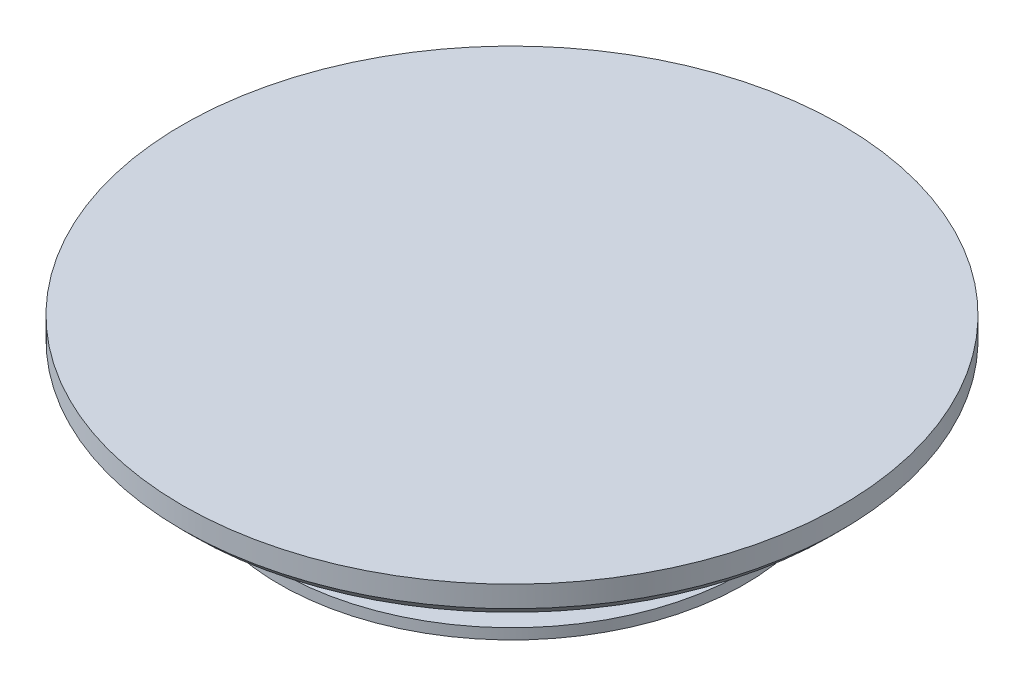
ISO-10303-21;
HEADER;
FILE_DESCRIPTION(('STEP AP214'),'2;1');
FILE_NAME('part.step','',(''),(''),'','','');
FILE_SCHEMA(('AUTOMOTIVE_DESIGN { 1 0 10303 214 1 1 1 1 }'));
ENDSEC;
DATA;
#1=APPLICATION_CONTEXT('core data for automotive mechanical design processes');
#2=APPLICATION_PROTOCOL_DEFINITION('international standard','automotive_design',2000,#1);
#3=PRODUCT_CONTEXT('',#1,'mechanical');
#4=PRODUCT('Part','Part','',(#3));
#5=PRODUCT_RELATED_PRODUCT_CATEGORY('part','',(#4));
#6=PRODUCT_DEFINITION_FORMATION('','',#4);
#7=PRODUCT_DEFINITION_CONTEXT('part definition',#1,'design');
#8=PRODUCT_DEFINITION('design','',#6,#7);
#9=PRODUCT_DEFINITION_SHAPE('','',#8);
#10=(LENGTH_UNIT() NAMED_UNIT(*) SI_UNIT(.MILLI.,.METRE.));
#11=(NAMED_UNIT(*) PLANE_ANGLE_UNIT() SI_UNIT($,.RADIAN.));
#12=(NAMED_UNIT(*) SI_UNIT($,.STERADIAN.) SOLID_ANGLE_UNIT());
#13=UNCERTAINTY_MEASURE_WITH_UNIT(LENGTH_MEASURE(1.E-05),#10,'distance_accuracy_value','');
#14=(GEOMETRIC_REPRESENTATION_CONTEXT(3) GLOBAL_UNCERTAINTY_ASSIGNED_CONTEXT((#13)) GLOBAL_UNIT_ASSIGNED_CONTEXT((#10,
#11,#12)) REPRESENTATION_CONTEXT('',''));
#15=CARTESIAN_POINT('',(0.,0.,0.));
#16=DIRECTION('',(0.,0.,1.));
#17=DIRECTION('',(1.,0.,0.));
#18=AXIS2_PLACEMENT_3D('',#15,#16,#17);
#19=CARTESIAN_POINT('',(0.,0.,0.));
#20=DIRECTION('',(0.,-1.,0.));
#21=DIRECTION('',(0.,0.,-1.));
#22=AXIS2_PLACEMENT_3D('',#19,#20,#21);
#23=CYLINDRICAL_SURFACE('',#22,10.9369024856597);
#24=CARTESIAN_POINT('',(0.,0.,0.));
#25=DIRECTION('',(0.,-1.,0.));
#26=DIRECTION('',(0.,0.,-1.));
#27=AXIS2_PLACEMENT_3D('',#24,#25,#26);
#28=CIRCLE('',#27,10.9369024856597);
#29=CARTESIAN_POINT('',(0.,0.,-10.9369024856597));
#30=VERTEX_POINT('',#29);
#31=EDGE_CURVE('E76',#30,#30,#28,.T.);
#32=ORIENTED_EDGE('',*,*,#31,.F.);
#33=EDGE_LOOP('',(#32));
#34=FACE_BOUND('',#33,.T.);
#35=CARTESIAN_POINT('',(0.,0.5,0.));
#36=DIRECTION('',(0.,-1.,0.));
#37=DIRECTION('',(0.,0.,-1.));
#38=AXIS2_PLACEMENT_3D('',#35,#36,#37);
#39=CIRCLE('',#38,10.9369024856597);
#40=CARTESIAN_POINT('',(0.,0.5,-10.9369024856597));
#41=VERTEX_POINT('',#40);
#42=EDGE_CURVE('E10',#41,#41,#39,.T.);
#43=ORIENTED_EDGE('',*,*,#42,.T.);
#44=EDGE_LOOP('',(#43));
#45=FACE_BOUND('',#44,.T.);
#46=ADVANCED_FACE('F45',(#34,#45),#23,.T.);
#47=CARTESIAN_POINT('',(0.,0.5,0.));
#48=DIRECTION('',(0.,-1.,0.));
#49=DIRECTION('',(0.,0.,-1.));
#50=AXIS2_PLACEMENT_3D('',#47,#48,#49);
#51=PLANE('',#50);
#52=ORIENTED_EDGE('',*,*,#42,.F.);
#53=EDGE_LOOP('',(#52));
#54=FACE_BOUND('',#53,.T.);
#55=CARTESIAN_POINT('',(0.,0.5,0.));
#56=DIRECTION('',(0.,-1.,0.));
#57=DIRECTION('',(0.,0.,-1.));
#58=AXIS2_PLACEMENT_3D('',#55,#56,#57);
#59=CIRCLE('',#58,9.93690248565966);
#60=CARTESIAN_POINT('',(0.,0.5,-9.93690248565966));
#61=VERTEX_POINT('',#60);
#62=EDGE_CURVE('E52',#61,#61,#59,.T.);
#63=ORIENTED_EDGE('',*,*,#62,.T.);
#64=EDGE_LOOP('',(#63));
#65=FACE_BOUND('',#64,.T.);
#66=ADVANCED_FACE('F84',(#54,#65),#51,.F.);
#67=CARTESIAN_POINT('',(0.,4.,0.));
#68=DIRECTION('',(0.,1.,0.));
#69=DIRECTION('',(0.,0.,1.));
#70=AXIS2_PLACEMENT_3D('',#67,#68,#69);
#71=CONICAL_SURFACE('',#70,12.,0.532630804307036);
#72=ORIENTED_EDGE('',*,*,#62,.F.);
#73=EDGE_LOOP('',(#72));
#74=FACE_BOUND('',#73,.T.);
#75=CARTESIAN_POINT('',(0.,4.,0.));
#76=DIRECTION('',(0.,-1.,0.));
#77=DIRECTION('',(0.,0.,-1.));
#78=AXIS2_PLACEMENT_3D('',#75,#76,#77);
#79=CIRCLE('',#78,12.);
#80=CARTESIAN_POINT('',(0.,4.,-12.));
#81=VERTEX_POINT('',#80);
#82=EDGE_CURVE('E57',#81,#81,#79,.T.);
#83=ORIENTED_EDGE('',*,*,#82,.T.);
#84=EDGE_LOOP('',(#83));
#85=FACE_BOUND('',#84,.T.);
#86=ADVANCED_FACE('F88',(#74,#85),#71,.T.);
#87=CARTESIAN_POINT('',(0.,4.,0.));
#88=DIRECTION('',(0.,1.,0.));
#89=DIRECTION('',(0.,0.,1.));
#90=AXIS2_PLACEMENT_3D('',#87,#88,#89);
#91=PLANE('',#90);
#92=ORIENTED_EDGE('',*,*,#82,.F.);
#93=EDGE_LOOP('',(#92));
#94=FACE_BOUND('',#93,.T.);
#95=CARTESIAN_POINT('',(0.,4.,0.));
#96=DIRECTION('',(0.,-1.,0.));
#97=DIRECTION('',(0.,0.,-1.));
#98=AXIS2_PLACEMENT_3D('',#95,#96,#97);
#99=CIRCLE('',#98,15.);
#100=CARTESIAN_POINT('',(0.,4.,-15.));
#101=VERTEX_POINT('',#100);
#102=EDGE_CURVE('E62',#101,#101,#99,.T.);
#103=ORIENTED_EDGE('',*,*,#102,.T.);
#104=EDGE_LOOP('',(#103));
#105=FACE_BOUND('',#104,.T.);
#106=ADVANCED_FACE('F93',(#94,#105),#91,.F.);
#107=CARTESIAN_POINT('',(0.,4.5,0.));
#108=DIRECTION('',(0.,1.,0.));
#109=DIRECTION('',(0.,0.,1.));
#110=AXIS2_PLACEMENT_3D('',#107,#108,#109);
#111=CONICAL_SURFACE('',#110,15.5,0.785398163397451);
#112=ORIENTED_EDGE('',*,*,#102,.F.);
#113=EDGE_LOOP('',(#112));
#114=FACE_BOUND('',#113,.T.);
#115=CARTESIAN_POINT('',(0.,4.5,0.));
#116=DIRECTION('',(0.,-1.,0.));
#117=DIRECTION('',(0.,0.,-1.));
#118=AXIS2_PLACEMENT_3D('',#115,#116,#117);
#119=CIRCLE('',#118,15.5);
#120=CARTESIAN_POINT('',(0.,4.5,-15.5));
#121=VERTEX_POINT('',#120);
#122=EDGE_CURVE('E68',#121,#121,#119,.T.);
#123=ORIENTED_EDGE('',*,*,#122,.T.);
#124=EDGE_LOOP('',(#123));
#125=FACE_BOUND('',#124,.T.);
#126=ADVANCED_FACE('F99',(#114,#125),#111,.T.);
#127=CARTESIAN_POINT('',(0.,0.,0.));
#128=DIRECTION('',(0.,-1.,0.));
#129=DIRECTION('',(0.,0.,-1.));
#130=AXIS2_PLACEMENT_3D('',#127,#128,#129);
#131=CYLINDRICAL_SURFACE('',#130,15.5);
#132=ORIENTED_EDGE('',*,*,#122,.F.);
#133=EDGE_LOOP('',(#132));
#134=FACE_BOUND('',#133,.T.);
#135=CARTESIAN_POINT('',(0.,5.5,0.));
#136=DIRECTION('',(0.,-1.,0.));
#137=DIRECTION('',(0.,0.,-1.));
#138=AXIS2_PLACEMENT_3D('',#135,#136,#137);
#139=CIRCLE('',#138,15.5);
#140=CARTESIAN_POINT('',(0.,5.5,-15.5));
#141=VERTEX_POINT('',#140);
#142=EDGE_CURVE('E72',#141,#141,#139,.T.);
#143=ORIENTED_EDGE('',*,*,#142,.T.);
#144=EDGE_LOOP('',(#143));
#145=FACE_BOUND('',#144,.T.);
#146=ADVANCED_FACE('F103',(#134,#145),#131,.T.);
#147=CARTESIAN_POINT('',(0.,5.5,0.));
#148=DIRECTION('',(0.,-1.,0.));
#149=DIRECTION('',(0.,0.,-1.));
#150=AXIS2_PLACEMENT_3D('',#147,#148,#149);
#151=PLANE('',#150);
#152=ORIENTED_EDGE('',*,*,#142,.F.);
#153=EDGE_LOOP('',(#152));
#154=FACE_BOUND('',#153,.T.);
#155=ADVANCED_FACE('F107',(#154),#151,.F.);
#156=CARTESIAN_POINT('',(0.,0.,0.));
#157=DIRECTION('',(0.,-1.,0.));
#158=DIRECTION('',(0.,0.,-1.));
#159=AXIS2_PLACEMENT_3D('',#156,#157,#158);
#160=PLANE('',#159);
#161=ORIENTED_EDGE('',*,*,#31,.T.);
#162=EDGE_LOOP('',(#161));
#163=FACE_BOUND('',#162,.T.);
#164=ADVANCED_FACE('F81',(#163),#160,.T.);
#165=CLOSED_SHELL('',(#46,#66,#86,#106,#126,#146,#155,#164));
#166=MANIFOLD_SOLID_BREP('B2',#165);
#167=ADVANCED_BREP_SHAPE_REPRESENTATION('',(#18,#166),#14);
#168=SHAPE_DEFINITION_REPRESENTATION(#9,#167);
ENDSEC;
END-ISO-10303-21;
